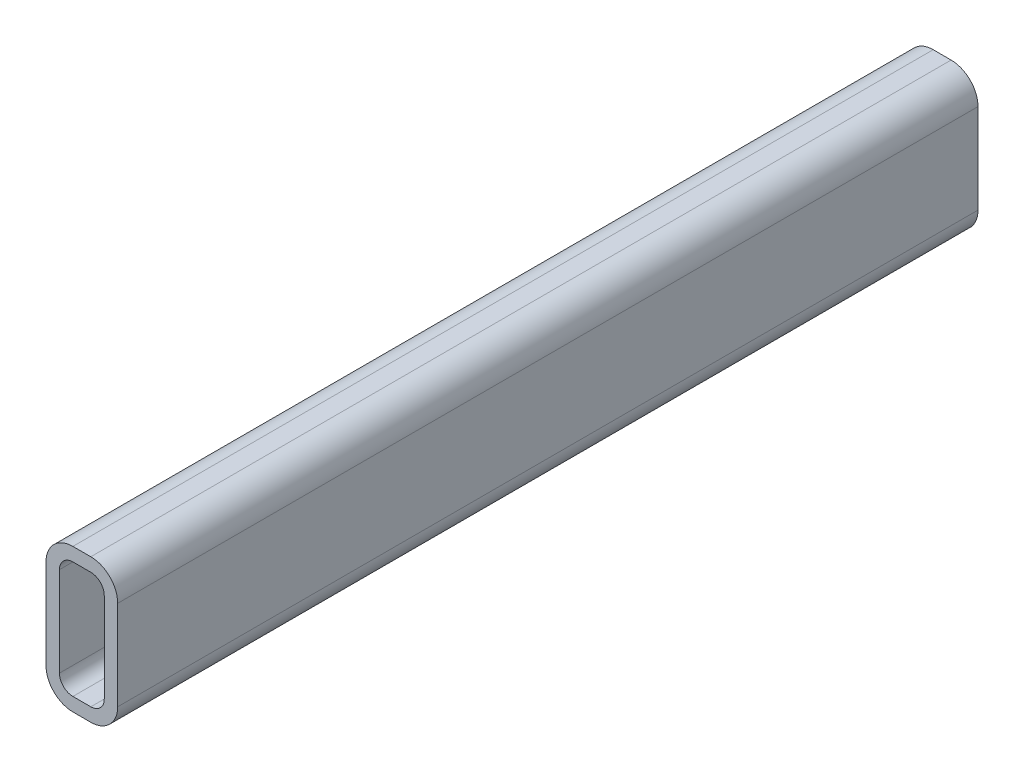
from build123d import *

# Parameters (mm, degrees)
BOSS_EXTRUDE1_DEPTH = 304.8


with BuildPart() as part:
    # Sketch1 → Boss-Extrude1 (new body)
    with BuildSketch(Plane.XY):
        with BuildLine():
            Line((9.525, 50.8), (15.875, 50.8))
            ThreePointArc((15.875, 50.8), (22.610192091, 48.010192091), (25.4, 41.275))
            Line((25.4, 41.275), (25.4, 9.525))
            ThreePointArc((25.4, 9.525), (22.610192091, 2.789807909), (15.875, 0))
            Line((15.875, 0), (9.525, 0))
            ThreePointArc((9.525, 0), (2.789807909, 2.789807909), (0, 9.525))
            Line((0, 9.525), (0, 41.275))
            ThreePointArc((0, 41.275), (2.789807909, 48.010192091), (9.525, 50.8))
        make_face()
        with BuildLine():
            Line((9.525, 46.0375), (15.875, 46.0375))
            ThreePointArc((15.875, 46.0375), (19.242596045, 44.642596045), (20.6375, 41.275))
            Line((20.6375, 41.275), (20.6375, 9.525))
            ThreePointArc((20.6375, 9.525), (19.242596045, 6.157403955), (15.875, 4.7625))
            Line((15.875, 4.7625), (9.525, 4.7625))
            ThreePointArc((9.525, 4.7625), (6.157403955, 6.157403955), (4.7625, 9.525))
            Line((4.7625, 9.525), (4.7625, 41.275))
            ThreePointArc((4.7625, 41.275), (6.157403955, 44.642596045), (9.525, 46.0375))
        make_face(mode=Mode.SUBTRACT)
    extrude(amount=BOSS_EXTRUDE1_DEPTH)


solid = part.part
